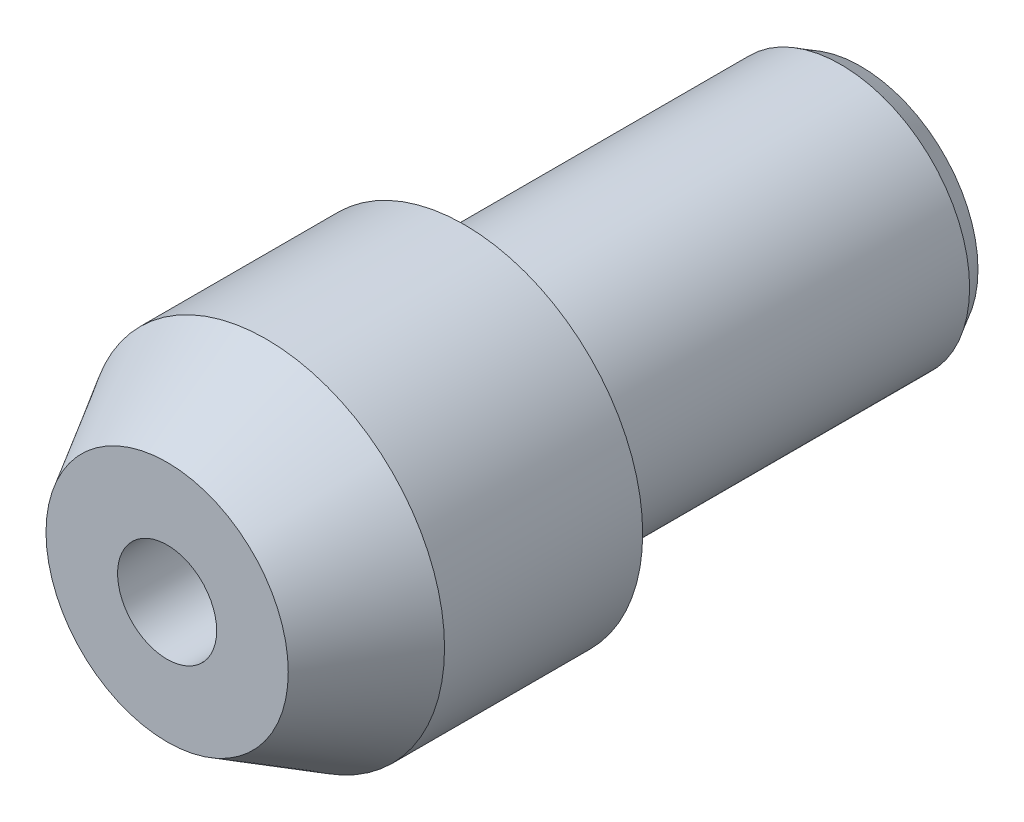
ISO-10303-21;
HEADER;
FILE_DESCRIPTION(('STEP AP214'),'2;1');
FILE_NAME('part.step','',(''),(''),'','','');
FILE_SCHEMA(('AUTOMOTIVE_DESIGN { 1 0 10303 214 1 1 1 1 }'));
ENDSEC;
DATA;
#1=APPLICATION_CONTEXT('core data for automotive mechanical design processes');
#2=APPLICATION_PROTOCOL_DEFINITION('international standard','automotive_design',2000,#1);
#3=PRODUCT_CONTEXT('',#1,'mechanical');
#4=PRODUCT('Part','Part','',(#3));
#5=PRODUCT_RELATED_PRODUCT_CATEGORY('part','',(#4));
#6=PRODUCT_DEFINITION_FORMATION('','',#4);
#7=PRODUCT_DEFINITION_CONTEXT('part definition',#1,'design');
#8=PRODUCT_DEFINITION('design','',#6,#7);
#9=PRODUCT_DEFINITION_SHAPE('','',#8);
#10=(LENGTH_UNIT() NAMED_UNIT(*) SI_UNIT(.MILLI.,.METRE.));
#11=(NAMED_UNIT(*) PLANE_ANGLE_UNIT() SI_UNIT($,.RADIAN.));
#12=(NAMED_UNIT(*) SI_UNIT($,.STERADIAN.) SOLID_ANGLE_UNIT());
#13=UNCERTAINTY_MEASURE_WITH_UNIT(LENGTH_MEASURE(1.E-05),#10,'distance_accuracy_value','');
#14=(GEOMETRIC_REPRESENTATION_CONTEXT(3) GLOBAL_UNCERTAINTY_ASSIGNED_CONTEXT((#13)) GLOBAL_UNIT_ASSIGNED_CONTEXT((#10,
#11,#12)) REPRESENTATION_CONTEXT('',''));
#15=CARTESIAN_POINT('',(0.,0.,0.));
#16=DIRECTION('',(0.,0.,1.));
#17=DIRECTION('',(1.,0.,0.));
#18=AXIS2_PLACEMENT_3D('',#15,#16,#17);
#19=CARTESIAN_POINT('',(0.,0.,-19.));
#20=DIRECTION('',(0.,0.,1.));
#21=DIRECTION('',(1.,0.,0.));
#22=AXIS2_PLACEMENT_3D('',#19,#20,#21);
#23=CONICAL_SURFACE('',#22,6.5,0.523598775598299);
#24=CARTESIAN_POINT('',(0.,0.,-20.));
#25=DIRECTION('',(0.,0.,1.));
#26=DIRECTION('',(1.,0.,0.));
#27=AXIS2_PLACEMENT_3D('',#24,#25,#26);
#28=CIRCLE('',#27,5.92264973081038);
#29=CARTESIAN_POINT('',(5.92264973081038,0.,-20.));
#30=VERTEX_POINT('',#29);
#31=EDGE_CURVE('E43',#30,#30,#28,.T.);
#32=ORIENTED_EDGE('',*,*,#31,.T.);
#33=EDGE_LOOP('',(#32));
#34=FACE_BOUND('',#33,.T.);
#35=CARTESIAN_POINT('',(0.,0.,-19.));
#36=DIRECTION('',(0.,0.,1.));
#37=DIRECTION('',(1.,0.,0.));
#38=AXIS2_PLACEMENT_3D('',#35,#36,#37);
#39=CIRCLE('',#38,6.5);
#40=CARTESIAN_POINT('',(6.5,0.,-19.));
#41=VERTEX_POINT('',#40);
#42=EDGE_CURVE('E8',#41,#41,#39,.T.);
#43=ORIENTED_EDGE('',*,*,#42,.F.);
#44=EDGE_LOOP('',(#43));
#45=FACE_BOUND('',#44,.T.);
#46=ADVANCED_FACE('F12',(#34,#45),#23,.T.);
#47=CARTESIAN_POINT('',(0.,0.,20.));
#48=DIRECTION('',(0.,0.,1.));
#49=DIRECTION('',(1.,0.,0.));
#50=AXIS2_PLACEMENT_3D('',#47,#48,#49);
#51=CYLINDRICAL_SURFACE('',#50,6.5);
#52=ORIENTED_EDGE('',*,*,#42,.T.);
#53=EDGE_LOOP('',(#52));
#54=FACE_BOUND('',#53,.T.);
#55=CARTESIAN_POINT('',(0.,0.,0.));
#56=DIRECTION('',(0.,0.,1.));
#57=DIRECTION('',(1.,0.,0.));
#58=AXIS2_PLACEMENT_3D('',#55,#56,#57);
#59=CIRCLE('',#58,6.5);
#60=CARTESIAN_POINT('',(6.5,0.,0.));
#61=VERTEX_POINT('',#60);
#62=EDGE_CURVE('E18',#61,#61,#59,.T.);
#63=ORIENTED_EDGE('',*,*,#62,.F.);
#64=EDGE_LOOP('',(#63));
#65=FACE_BOUND('',#64,.T.);
#66=ADVANCED_FACE('F72',(#54,#65),#51,.T.);
#67=CARTESIAN_POINT('',(6.5,0.,0.));
#68=DIRECTION('',(0.,0.,1.));
#69=DIRECTION('',(1.,0.,0.));
#70=AXIS2_PLACEMENT_3D('',#67,#68,#69);
#71=PLANE('',#70);
#72=CARTESIAN_POINT('',(0.,0.,0.));
#73=DIRECTION('',(0.,0.,1.));
#74=DIRECTION('',(1.,0.,0.));
#75=AXIS2_PLACEMENT_3D('',#72,#73,#74);
#76=CIRCLE('',#75,9.);
#77=CARTESIAN_POINT('',(9.,0.,0.));
#78=VERTEX_POINT('',#77);
#79=EDGE_CURVE('E22',#78,#78,#76,.T.);
#80=ORIENTED_EDGE('',*,*,#79,.F.);
#81=EDGE_LOOP('',(#80));
#82=FACE_BOUND('',#81,.T.);
#83=ORIENTED_EDGE('',*,*,#62,.T.);
#84=EDGE_LOOP('',(#83));
#85=FACE_BOUND('',#84,.T.);
#86=ADVANCED_FACE('F77',(#82,#85),#71,.F.);
#87=CARTESIAN_POINT('',(0.,0.,20.));
#88=DIRECTION('',(0.,0.,1.));
#89=DIRECTION('',(1.,0.,0.));
#90=AXIS2_PLACEMENT_3D('',#87,#88,#89);
#91=CYLINDRICAL_SURFACE('',#90,9.);
#92=ORIENTED_EDGE('',*,*,#79,.T.);
#93=EDGE_LOOP('',(#92));
#94=FACE_BOUND('',#93,.T.);
#95=CARTESIAN_POINT('',(0.,0.,10.));
#96=DIRECTION('',(0.,0.,1.));
#97=DIRECTION('',(1.,0.,0.));
#98=AXIS2_PLACEMENT_3D('',#95,#96,#97);
#99=CIRCLE('',#98,9.);
#100=CARTESIAN_POINT('',(9.,0.,10.));
#101=VERTEX_POINT('',#100);
#102=EDGE_CURVE('E26',#101,#101,#99,.T.);
#103=ORIENTED_EDGE('',*,*,#102,.F.);
#104=EDGE_LOOP('',(#103));
#105=FACE_BOUND('',#104,.T.);
#106=ADVANCED_FACE('F68',(#94,#105),#91,.T.);
#107=CARTESIAN_POINT('',(0.,0.,10.));
#108=DIRECTION('',(0.,0.,-1.));
#109=DIRECTION('',(-1.,0.,0.));
#110=AXIS2_PLACEMENT_3D('',#107,#108,#109);
#111=CONICAL_SURFACE('',#110,9.,0.523598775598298);
#112=CARTESIAN_POINT('',(0.,0.,15.));
#113=DIRECTION('',(0.,0.,1.));
#114=DIRECTION('',(1.,0.,0.));
#115=AXIS2_PLACEMENT_3D('',#112,#113,#114);
#116=CIRCLE('',#115,6.11324865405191);
#117=CARTESIAN_POINT('',(6.11324865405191,0.,15.));
#118=VERTEX_POINT('',#117);
#119=EDGE_CURVE('E31',#118,#118,#116,.T.);
#120=ORIENTED_EDGE('',*,*,#119,.F.);
#121=EDGE_LOOP('',(#120));
#122=FACE_BOUND('',#121,.T.);
#123=ORIENTED_EDGE('',*,*,#102,.T.);
#124=EDGE_LOOP('',(#123));
#125=FACE_BOUND('',#124,.T.);
#126=ADVANCED_FACE('F61',(#122,#125),#111,.T.);
#127=CARTESIAN_POINT('',(2.5,0.,15.));
#128=DIRECTION('',(0.,0.,1.));
#129=DIRECTION('',(1.,0.,0.));
#130=AXIS2_PLACEMENT_3D('',#127,#128,#129);
#131=PLANE('',#130);
#132=ORIENTED_EDGE('',*,*,#119,.T.);
#133=EDGE_LOOP('',(#132));
#134=FACE_BOUND('',#133,.T.);
#135=CARTESIAN_POINT('',(0.,0.,15.));
#136=DIRECTION('',(0.,0.,1.));
#137=DIRECTION('',(1.,0.,0.));
#138=AXIS2_PLACEMENT_3D('',#135,#136,#137);
#139=CIRCLE('',#138,2.5);
#140=CARTESIAN_POINT('',(2.5,0.,15.));
#141=VERTEX_POINT('',#140);
#142=EDGE_CURVE('E34',#141,#141,#139,.T.);
#143=ORIENTED_EDGE('',*,*,#142,.F.);
#144=EDGE_LOOP('',(#143));
#145=FACE_BOUND('',#144,.T.);
#146=ADVANCED_FACE('F56',(#134,#145),#131,.T.);
#147=CARTESIAN_POINT('',(0.,0.,20.));
#148=DIRECTION('',(0.,0.,1.));
#149=DIRECTION('',(1.,0.,0.));
#150=AXIS2_PLACEMENT_3D('',#147,#148,#149);
#151=CYLINDRICAL_SURFACE('',#150,2.5);
#152=CARTESIAN_POINT('',(0.,0.,7.));
#153=DIRECTION('',(0.,0.,1.));
#154=DIRECTION('',(1.,0.,0.));
#155=AXIS2_PLACEMENT_3D('',#152,#153,#154);
#156=CIRCLE('',#155,2.5);
#157=CARTESIAN_POINT('',(2.5,0.,7.));
#158=VERTEX_POINT('',#157);
#159=EDGE_CURVE('E46',#158,#158,#156,.T.);
#160=ORIENTED_EDGE('',*,*,#159,.F.);
#161=EDGE_LOOP('',(#160));
#162=FACE_BOUND('',#161,.T.);
#163=ORIENTED_EDGE('',*,*,#142,.T.);
#164=EDGE_LOOP('',(#163));
#165=FACE_BOUND('',#164,.T.);
#166=ADVANCED_FACE('F52',(#162,#165),#151,.F.);
#167=CARTESIAN_POINT('',(0.,0.,-16.));
#168=DIRECTION('',(0.,0.,1.));
#169=DIRECTION('',(1.,0.,0.));
#170=AXIS2_PLACEMENT_3D('',#167,#168,#169);
#171=PLANE('',#170);
#172=CARTESIAN_POINT('',(0.,0.,-16.));
#173=DIRECTION('',(0.,0.,1.));
#174=DIRECTION('',(1.,0.,0.));
#175=AXIS2_PLACEMENT_3D('',#172,#173,#174);
#176=CIRCLE('',#175,1.);
#177=CARTESIAN_POINT('',(1.,0.,-16.));
#178=VERTEX_POINT('',#177);
#179=EDGE_CURVE('E37',#178,#178,#176,.T.);
#180=ORIENTED_EDGE('',*,*,#179,.F.);
#181=EDGE_LOOP('',(#180));
#182=FACE_BOUND('',#181,.T.);
#183=ADVANCED_FACE('F55',(#182),#171,.F.);
#184=CARTESIAN_POINT('',(0.,0.,20.));
#185=DIRECTION('',(0.,0.,1.));
#186=DIRECTION('',(1.,0.,0.));
#187=AXIS2_PLACEMENT_3D('',#184,#185,#186);
#188=CYLINDRICAL_SURFACE('',#187,1.);
#189=CARTESIAN_POINT('',(0.,0.,-20.));
#190=DIRECTION('',(0.,0.,1.));
#191=DIRECTION('',(1.,0.,0.));
#192=AXIS2_PLACEMENT_3D('',#189,#190,#191);
#193=CIRCLE('',#192,1.);
#194=CARTESIAN_POINT('',(1.,0.,-20.));
#195=VERTEX_POINT('',#194);
#196=EDGE_CURVE('E40',#195,#195,#193,.T.);
#197=ORIENTED_EDGE('',*,*,#196,.F.);
#198=EDGE_LOOP('',(#197));
#199=FACE_BOUND('',#198,.T.);
#200=ORIENTED_EDGE('',*,*,#179,.T.);
#201=EDGE_LOOP('',(#200));
#202=FACE_BOUND('',#201,.T.);
#203=ADVANCED_FACE('F84',(#199,#202),#188,.F.);
#204=CARTESIAN_POINT('',(1.,0.,-20.));
#205=DIRECTION('',(0.,0.,1.));
#206=DIRECTION('',(1.,0.,0.));
#207=AXIS2_PLACEMENT_3D('',#204,#205,#206);
#208=PLANE('',#207);
#209=ORIENTED_EDGE('',*,*,#31,.F.);
#210=EDGE_LOOP('',(#209));
#211=FACE_BOUND('',#210,.T.);
#212=ORIENTED_EDGE('',*,*,#196,.T.);
#213=EDGE_LOOP('',(#212));
#214=FACE_BOUND('',#213,.T.);
#215=ADVANCED_FACE('F81',(#211,#214),#208,.F.);
#216=CARTESIAN_POINT('',(0.,0.,7.));
#217=DIRECTION('',(0.,0.,1.));
#218=DIRECTION('',(1.,0.,0.));
#219=AXIS2_PLACEMENT_3D('',#216,#217,#218);
#220=PLANE('',#219);
#221=ORIENTED_EDGE('',*,*,#159,.T.);
#222=EDGE_LOOP('',(#221));
#223=FACE_BOUND('',#222,.T.);
#224=ADVANCED_FACE('F50',(#223),#220,.T.);
#225=CLOSED_SHELL('',(#46,#66,#86,#106,#126,#146,#166,#183,#203,#215,#224));
#226=MANIFOLD_SOLID_BREP('B1',#225);
#227=ADVANCED_BREP_SHAPE_REPRESENTATION('',(#18,#226),#14);
#228=SHAPE_DEFINITION_REPRESENTATION(#9,#227);
ENDSEC;
END-ISO-10303-21;
